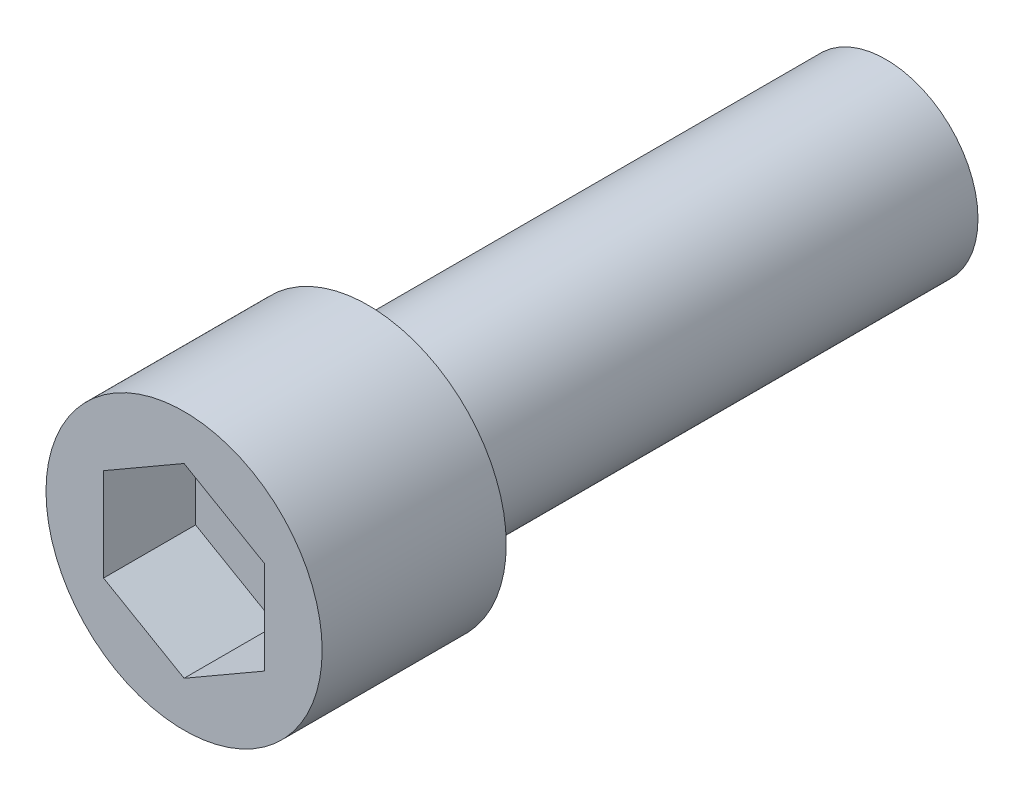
ISO-10303-21;
HEADER;
FILE_DESCRIPTION(('STEP AP214'),'2;1');
FILE_NAME('part.step','',(''),(''),'','','');
FILE_SCHEMA(('AUTOMOTIVE_DESIGN { 1 0 10303 214 1 1 1 1 }'));
ENDSEC;
DATA;
#1=APPLICATION_CONTEXT('core data for automotive mechanical design processes');
#2=APPLICATION_PROTOCOL_DEFINITION('international standard','automotive_design',2000,#1);
#3=PRODUCT_CONTEXT('',#1,'mechanical');
#4=PRODUCT('Part','Part','',(#3));
#5=PRODUCT_RELATED_PRODUCT_CATEGORY('part','',(#4));
#6=PRODUCT_DEFINITION_FORMATION('','',#4);
#7=PRODUCT_DEFINITION_CONTEXT('part definition',#1,'design');
#8=PRODUCT_DEFINITION('design','',#6,#7);
#9=PRODUCT_DEFINITION_SHAPE('','',#8);
#10=(LENGTH_UNIT() NAMED_UNIT(*) SI_UNIT(.MILLI.,.METRE.));
#11=(NAMED_UNIT(*) PLANE_ANGLE_UNIT() SI_UNIT($,.RADIAN.));
#12=(NAMED_UNIT(*) SI_UNIT($,.STERADIAN.) SOLID_ANGLE_UNIT());
#13=UNCERTAINTY_MEASURE_WITH_UNIT(LENGTH_MEASURE(1.E-05),#10,'distance_accuracy_value','');
#14=(GEOMETRIC_REPRESENTATION_CONTEXT(3) GLOBAL_UNCERTAINTY_ASSIGNED_CONTEXT((#13)) GLOBAL_UNIT_ASSIGNED_CONTEXT((#10,
#11,#12)) REPRESENTATION_CONTEXT('',''));
#15=CARTESIAN_POINT('',(0.,0.,0.));
#16=DIRECTION('',(0.,0.,1.));
#17=DIRECTION('',(1.,0.,0.));
#18=AXIS2_PLACEMENT_3D('',#15,#16,#17);
#19=CARTESIAN_POINT('',(0.,8.08290376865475,8.));
#20=DIRECTION('',(-0.5,-0.86602540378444,0.));
#21=DIRECTION('',(0.86602540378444,-0.5,0.));
#22=AXIS2_PLACEMENT_3D('',#19,#20,#21);
#23=PLANE('',#22);
#24=DIRECTION('',(0.,0.,1.));
#25=VECTOR('',#24,1.);
#26=CARTESIAN_POINT('',(7.,4.04145188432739,8.));
#27=LINE('',#26,#25);
#28=CARTESIAN_POINT('',(7.,4.04145188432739,8.));
#29=VERTEX_POINT('',#28);
#30=CARTESIAN_POINT('',(7.,4.04145188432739,16.));
#31=VERTEX_POINT('',#30);
#32=EDGE_CURVE('E63',#29,#31,#27,.T.);
#33=ORIENTED_EDGE('',*,*,#32,.T.);
#34=DIRECTION('',(0.86602540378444,-0.5,0.));
#35=VECTOR('',#34,1.);
#36=CARTESIAN_POINT('',(0.,8.08290376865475,16.));
#37=LINE('',#36,#35);
#38=CARTESIAN_POINT('',(0.,8.08290376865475,16.));
#39=VERTEX_POINT('',#38);
#40=EDGE_CURVE('E29',#39,#31,#37,.T.);
#41=ORIENTED_EDGE('',*,*,#40,.F.);
#42=DIRECTION('',(0.,0.,1.));
#43=VECTOR('',#42,1.);
#44=CARTESIAN_POINT('',(0.,8.08290376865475,8.));
#45=LINE('',#44,#43);
#46=CARTESIAN_POINT('',(0.,8.08290376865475,8.));
#47=VERTEX_POINT('',#46);
#48=EDGE_CURVE('E33',#47,#39,#45,.T.);
#49=ORIENTED_EDGE('',*,*,#48,.F.);
#50=DIRECTION('',(0.86602540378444,-0.5,0.));
#51=VECTOR('',#50,1.);
#52=CARTESIAN_POINT('',(0.,8.08290376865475,8.));
#53=LINE('',#52,#51);
#54=EDGE_CURVE('E65',#47,#29,#53,.T.);
#55=ORIENTED_EDGE('',*,*,#54,.T.);
#56=EDGE_LOOP('',(#33,#41,#49,#55));
#57=FACE_BOUND('',#56,.T.);
#58=ADVANCED_FACE('F14',(#57),#23,.T.);
#59=CARTESIAN_POINT('',(7.,-4.04145188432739,8.));
#60=DIRECTION('',(1.,0.,0.));
#61=DIRECTION('',(0.,1.,0.));
#62=AXIS2_PLACEMENT_3D('',#59,#60,#61);
#63=PLANE('',#62);
#64=DIRECTION('',(0.,0.,1.));
#65=VECTOR('',#64,1.);
#66=CARTESIAN_POINT('',(7.,-4.04145188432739,8.));
#67=LINE('',#66,#65);
#68=CARTESIAN_POINT('',(7.,-4.04145188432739,8.));
#69=VERTEX_POINT('',#68);
#70=CARTESIAN_POINT('',(7.,-4.04145188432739,16.));
#71=VERTEX_POINT('',#70);
#72=EDGE_CURVE('E70',#69,#71,#67,.T.);
#73=ORIENTED_EDGE('',*,*,#72,.T.);
#74=DIRECTION('',(0.,1.,0.));
#75=VECTOR('',#74,1.);
#76=CARTESIAN_POINT('',(7.,-4.04145188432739,16.));
#77=LINE('',#76,#75);
#78=EDGE_CURVE('E73',#71,#31,#77,.T.);
#79=ORIENTED_EDGE('',*,*,#78,.T.);
#80=ORIENTED_EDGE('',*,*,#32,.F.);
#81=DIRECTION('',(0.,1.,0.));
#82=VECTOR('',#81,1.);
#83=CARTESIAN_POINT('',(7.,-4.04145188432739,8.));
#84=LINE('',#83,#82);
#85=EDGE_CURVE('E102',#69,#29,#84,.T.);
#86=ORIENTED_EDGE('',*,*,#85,.F.);
#87=EDGE_LOOP('',(#73,#79,#80,#86));
#88=FACE_BOUND('',#87,.T.);
#89=ADVANCED_FACE('F74',(#88),#63,.F.);
#90=CARTESIAN_POINT('',(0.,-8.08290376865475,8.));
#91=DIRECTION('',(0.5,-0.86602540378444,0.));
#92=DIRECTION('',(0.86602540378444,0.5,0.));
#93=AXIS2_PLACEMENT_3D('',#90,#91,#92);
#94=PLANE('',#93);
#95=DIRECTION('',(0.,0.,1.));
#96=VECTOR('',#95,1.);
#97=CARTESIAN_POINT('',(0.,-8.08290376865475,8.));
#98=LINE('',#97,#96);
#99=CARTESIAN_POINT('',(0.,-8.08290376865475,8.));
#100=VERTEX_POINT('',#99);
#101=CARTESIAN_POINT('',(0.,-8.08290376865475,16.));
#102=VERTEX_POINT('',#101);
#103=EDGE_CURVE('E110',#100,#102,#98,.T.);
#104=ORIENTED_EDGE('',*,*,#103,.T.);
#105=DIRECTION('',(0.86602540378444,0.5,0.));
#106=VECTOR('',#105,1.);
#107=CARTESIAN_POINT('',(0.,-8.08290376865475,16.));
#108=LINE('',#107,#106);
#109=EDGE_CURVE('E78',#102,#71,#108,.T.);
#110=ORIENTED_EDGE('',*,*,#109,.T.);
#111=ORIENTED_EDGE('',*,*,#72,.F.);
#112=DIRECTION('',(0.86602540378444,0.5,0.));
#113=VECTOR('',#112,1.);
#114=CARTESIAN_POINT('',(0.,-8.08290376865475,8.));
#115=LINE('',#114,#113);
#116=EDGE_CURVE('E99',#100,#69,#115,.T.);
#117=ORIENTED_EDGE('',*,*,#116,.F.);
#118=EDGE_LOOP('',(#104,#110,#111,#117));
#119=FACE_BOUND('',#118,.T.);
#120=ADVANCED_FACE('F140',(#119),#94,.F.);
#121=CARTESIAN_POINT('',(0.,-8.08290376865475,8.));
#122=DIRECTION('',(0.5,0.86602540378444,0.));
#123=DIRECTION('',(-0.86602540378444,0.5,0.));
#124=AXIS2_PLACEMENT_3D('',#121,#122,#123);
#125=PLANE('',#124);
#126=DIRECTION('',(0.,0.,1.));
#127=VECTOR('',#126,1.);
#128=CARTESIAN_POINT('',(-7.,-4.04145188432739,8.));
#129=LINE('',#128,#127);
#130=CARTESIAN_POINT('',(-7.,-4.04145188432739,8.));
#131=VERTEX_POINT('',#130);
#132=CARTESIAN_POINT('',(-7.,-4.04145188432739,16.));
#133=VERTEX_POINT('',#132);
#134=EDGE_CURVE('E108',#131,#133,#129,.T.);
#135=ORIENTED_EDGE('',*,*,#134,.T.);
#136=DIRECTION('',(-0.86602540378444,0.5,0.));
#137=VECTOR('',#136,1.);
#138=CARTESIAN_POINT('',(0.,-8.08290376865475,16.));
#139=LINE('',#138,#137);
#140=EDGE_CURVE('E167',#102,#133,#139,.T.);
#141=ORIENTED_EDGE('',*,*,#140,.F.);
#142=ORIENTED_EDGE('',*,*,#103,.F.);
#143=DIRECTION('',(-0.86602540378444,0.5,0.));
#144=VECTOR('',#143,1.);
#145=CARTESIAN_POINT('',(0.,-8.08290376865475,8.));
#146=LINE('',#145,#144);
#147=EDGE_CURVE('E96',#100,#131,#146,.T.);
#148=ORIENTED_EDGE('',*,*,#147,.T.);
#149=EDGE_LOOP('',(#135,#141,#142,#148));
#150=FACE_BOUND('',#149,.T.);
#151=ADVANCED_FACE('F153',(#150),#125,.T.);
#152=CARTESIAN_POINT('',(-7.,4.04145188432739,8.));
#153=DIRECTION('',(-1.,0.,0.));
#154=DIRECTION('',(0.,-1.,0.));
#155=AXIS2_PLACEMENT_3D('',#152,#153,#154);
#156=PLANE('',#155);
#157=DIRECTION('',(0.,0.,1.));
#158=VECTOR('',#157,1.);
#159=CARTESIAN_POINT('',(-7.,4.04145188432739,8.));
#160=LINE('',#159,#158);
#161=CARTESIAN_POINT('',(-7.,4.04145188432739,8.));
#162=VERTEX_POINT('',#161);
#163=CARTESIAN_POINT('',(-7.,4.04145188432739,16.));
#164=VERTEX_POINT('',#163);
#165=EDGE_CURVE('E106',#162,#164,#160,.T.);
#166=ORIENTED_EDGE('',*,*,#165,.T.);
#167=DIRECTION('',(0.,-1.,0.));
#168=VECTOR('',#167,1.);
#169=CARTESIAN_POINT('',(-7.,4.04145188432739,16.));
#170=LINE('',#169,#168);
#171=EDGE_CURVE('E169',#164,#133,#170,.T.);
#172=ORIENTED_EDGE('',*,*,#171,.T.);
#173=ORIENTED_EDGE('',*,*,#134,.F.);
#174=DIRECTION('',(0.,-1.,0.));
#175=VECTOR('',#174,1.);
#176=CARTESIAN_POINT('',(-7.,4.04145188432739,8.));
#177=LINE('',#176,#175);
#178=EDGE_CURVE('E93',#162,#131,#177,.T.);
#179=ORIENTED_EDGE('',*,*,#178,.F.);
#180=EDGE_LOOP('',(#166,#172,#173,#179));
#181=FACE_BOUND('',#180,.T.);
#182=ADVANCED_FACE('F149',(#181),#156,.F.);
#183=CARTESIAN_POINT('',(0.,8.08290376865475,8.));
#184=DIRECTION('',(-0.5,0.86602540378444,0.));
#185=DIRECTION('',(-0.86602540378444,-0.5,0.));
#186=AXIS2_PLACEMENT_3D('',#183,#184,#185);
#187=PLANE('',#186);
#188=DIRECTION('',(-0.86602540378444,-0.5,0.));
#189=VECTOR('',#188,1.);
#190=CARTESIAN_POINT('',(0.,8.08290376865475,8.));
#191=LINE('',#190,#189);
#192=EDGE_CURVE('E90',#47,#162,#191,.T.);
#193=ORIENTED_EDGE('',*,*,#192,.F.);
#194=ORIENTED_EDGE('',*,*,#48,.T.);
#195=DIRECTION('',(-0.86602540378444,-0.5,0.));
#196=VECTOR('',#195,1.);
#197=CARTESIAN_POINT('',(0.,8.08290376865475,16.));
#198=LINE('',#197,#196);
#199=EDGE_CURVE('E83',#39,#164,#198,.T.);
#200=ORIENTED_EDGE('',*,*,#199,.T.);
#201=ORIENTED_EDGE('',*,*,#165,.F.);
#202=EDGE_LOOP('',(#193,#194,#200,#201));
#203=FACE_BOUND('',#202,.T.);
#204=ADVANCED_FACE('F146',(#203),#187,.F.);
#205=CARTESIAN_POINT('',(-7.,12.1243556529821,8.));
#206=DIRECTION('',(0.,0.,-1.));
#207=DIRECTION('',(-1.,0.,0.));
#208=AXIS2_PLACEMENT_3D('',#205,#206,#207);
#209=PLANE('',#208);
#210=ORIENTED_EDGE('',*,*,#54,.F.);
#211=ORIENTED_EDGE('',*,*,#192,.T.);
#212=ORIENTED_EDGE('',*,*,#178,.T.);
#213=ORIENTED_EDGE('',*,*,#147,.F.);
#214=ORIENTED_EDGE('',*,*,#116,.T.);
#215=ORIENTED_EDGE('',*,*,#85,.T.);
#216=EDGE_LOOP('',(#210,#211,#212,#213,#214,#215));
#217=FACE_BOUND('',#216,.T.);
#218=ADVANCED_FACE('F144',(#217),#209,.F.);
#219=CARTESIAN_POINT('',(0.,0.,16.));
#220=DIRECTION('',(0.,0.,1.));
#221=DIRECTION('',(1.,0.,0.));
#222=AXIS2_PLACEMENT_3D('',#219,#220,#221);
#223=PLANE('',#222);
#224=CARTESIAN_POINT('',(0.,0.,16.));
#225=DIRECTION('',(0.,0.,1.));
#226=DIRECTION('',(1.,0.,0.));
#227=AXIS2_PLACEMENT_3D('',#224,#225,#226);
#228=CIRCLE('',#227,12.);
#229=CARTESIAN_POINT('',(12.,0.,16.));
#230=VERTEX_POINT('',#229);
#231=EDGE_CURVE('E9',#230,#230,#228,.T.);
#232=ORIENTED_EDGE('',*,*,#231,.T.);
#233=EDGE_LOOP('',(#232));
#234=FACE_BOUND('',#233,.T.);
#235=ORIENTED_EDGE('',*,*,#199,.F.);
#236=ORIENTED_EDGE('',*,*,#40,.T.);
#237=ORIENTED_EDGE('',*,*,#78,.F.);
#238=ORIENTED_EDGE('',*,*,#109,.F.);
#239=ORIENTED_EDGE('',*,*,#140,.T.);
#240=ORIENTED_EDGE('',*,*,#171,.F.);
#241=EDGE_LOOP('',(#235,#236,#237,#238,#239,#240));
#242=FACE_BOUND('',#241,.T.);
#243=ADVANCED_FACE('F16',(#234,#242),#223,.T.);
#244=CARTESIAN_POINT('',(0.,0.,-20.));
#245=DIRECTION('',(0.,0.,1.));
#246=DIRECTION('',(1.,0.,0.));
#247=AXIS2_PLACEMENT_3D('',#244,#245,#246);
#248=CYLINDRICAL_SURFACE('',#247,12.);
#249=CARTESIAN_POINT('',(0.,0.,0.));
#250=DIRECTION('',(0.,0.,1.));
#251=DIRECTION('',(1.,0.,0.));
#252=AXIS2_PLACEMENT_3D('',#249,#250,#251);
#253=CIRCLE('',#252,12.);
#254=CARTESIAN_POINT('',(12.,0.,0.));
#255=VERTEX_POINT('',#254);
#256=EDGE_CURVE('E22',#255,#255,#253,.T.);
#257=ORIENTED_EDGE('',*,*,#256,.T.);
#258=EDGE_LOOP('',(#257));
#259=FACE_BOUND('',#258,.T.);
#260=ORIENTED_EDGE('',*,*,#231,.F.);
#261=EDGE_LOOP('',(#260));
#262=FACE_BOUND('',#261,.T.);
#263=ADVANCED_FACE('F117',(#259,#262),#248,.T.);
#264=CARTESIAN_POINT('',(12.,0.,0.));
#265=DIRECTION('',(0.,0.,-1.));
#266=DIRECTION('',(-1.,0.,0.));
#267=AXIS2_PLACEMENT_3D('',#264,#265,#266);
#268=PLANE('',#267);
#269=CARTESIAN_POINT('',(0.,0.,0.));
#270=DIRECTION('',(0.,0.,1.));
#271=DIRECTION('',(1.,0.,0.));
#272=AXIS2_PLACEMENT_3D('',#269,#270,#271);
#273=CIRCLE('',#272,8.);
#274=CARTESIAN_POINT('',(8.,0.,0.));
#275=VERTEX_POINT('',#274);
#276=EDGE_CURVE('E69',#275,#275,#273,.T.);
#277=ORIENTED_EDGE('',*,*,#276,.T.);
#278=EDGE_LOOP('',(#277));
#279=FACE_BOUND('',#278,.T.);
#280=ORIENTED_EDGE('',*,*,#256,.F.);
#281=EDGE_LOOP('',(#280));
#282=FACE_BOUND('',#281,.T.);
#283=ADVANCED_FACE('F120',(#279,#282),#268,.T.);
#284=CARTESIAN_POINT('',(0.,0.,-20.));
#285=DIRECTION('',(0.,0.,1.));
#286=DIRECTION('',(1.,0.,0.));
#287=AXIS2_PLACEMENT_3D('',#284,#285,#286);
#288=CYLINDRICAL_SURFACE('',#287,8.);
#289=ORIENTED_EDGE('',*,*,#276,.F.);
#290=EDGE_LOOP('',(#289));
#291=FACE_BOUND('',#290,.T.);
#292=CARTESIAN_POINT('',(0.,0.,-45.));
#293=DIRECTION('',(0.,0.,-1.));
#294=DIRECTION('',(-1.,0.,0.));
#295=AXIS2_PLACEMENT_3D('',#292,#293,#294);
#296=CIRCLE('',#295,8.);
#297=CARTESIAN_POINT('',(-8.,0.,-45.));
#298=VERTEX_POINT('',#297);
#299=EDGE_CURVE('E84',#298,#298,#296,.T.);
#300=ORIENTED_EDGE('',*,*,#299,.F.);
#301=EDGE_LOOP('',(#300));
#302=FACE_BOUND('',#301,.T.);
#303=ADVANCED_FACE('F122',(#291,#302),#288,.T.);
#304=CARTESIAN_POINT('',(0.,0.,-45.));
#305=DIRECTION('',(0.,0.,-1.));
#306=DIRECTION('',(-1.,0.,0.));
#307=AXIS2_PLACEMENT_3D('',#304,#305,#306);
#308=PLANE('',#307);
#309=ORIENTED_EDGE('',*,*,#299,.T.);
#310=EDGE_LOOP('',(#309));
#311=FACE_BOUND('',#310,.T.);
#312=ADVANCED_FACE('F131',(#311),#308,.T.);
#313=CLOSED_SHELL('',(#58,#89,#120,#151,#182,#204,#218,#243,#263,#283,#303,#312));
#314=MANIFOLD_SOLID_BREP('B1',#313);
#315=ADVANCED_BREP_SHAPE_REPRESENTATION('',(#18,#314),#14);
#316=SHAPE_DEFINITION_REPRESENTATION(#9,#315);
ENDSEC;
END-ISO-10303-21;
